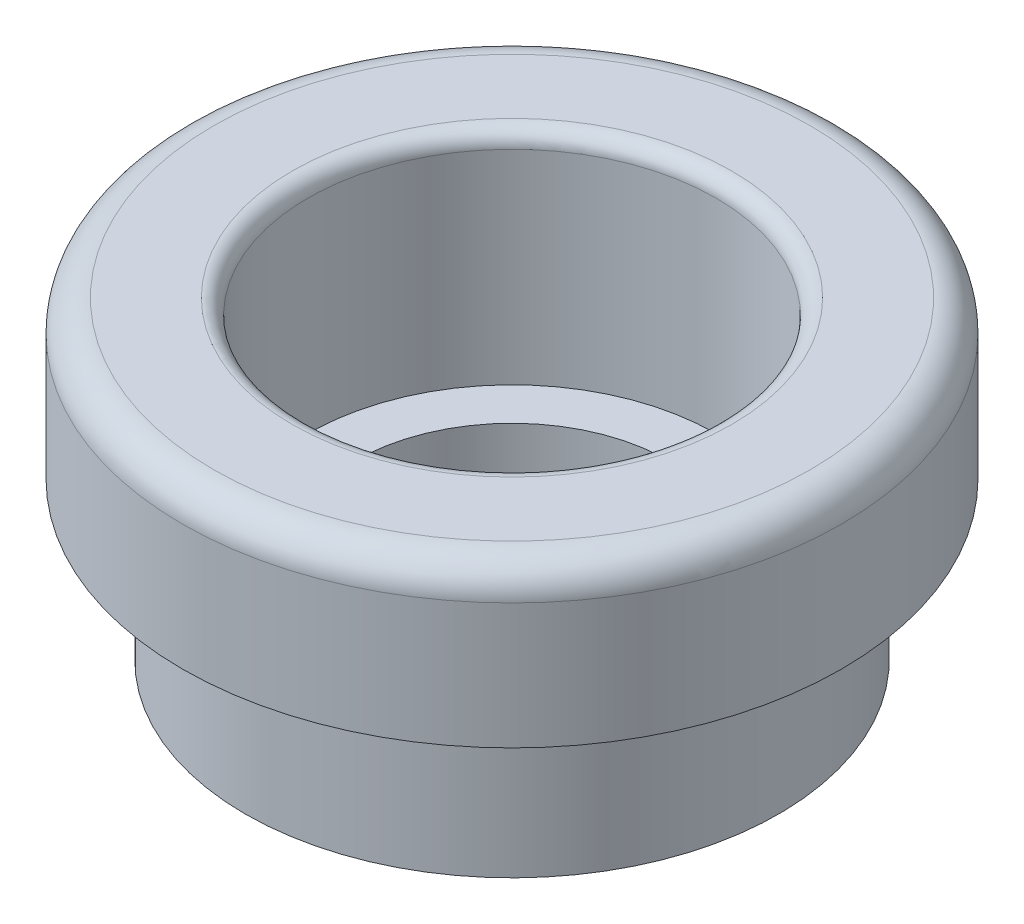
ISO-10303-21;
HEADER;
FILE_DESCRIPTION(('STEP AP214'),'2;1');
FILE_NAME('part.step','',(''),(''),'','','');
FILE_SCHEMA(('AUTOMOTIVE_DESIGN { 1 0 10303 214 1 1 1 1 }'));
ENDSEC;
DATA;
#1=APPLICATION_CONTEXT('core data for automotive mechanical design processes');
#2=APPLICATION_PROTOCOL_DEFINITION('international standard','automotive_design',2000,#1);
#3=PRODUCT_CONTEXT('',#1,'mechanical');
#4=PRODUCT('Part','Part','',(#3));
#5=PRODUCT_RELATED_PRODUCT_CATEGORY('part','',(#4));
#6=PRODUCT_DEFINITION_FORMATION('','',#4);
#7=PRODUCT_DEFINITION_CONTEXT('part definition',#1,'design');
#8=PRODUCT_DEFINITION('design','',#6,#7);
#9=PRODUCT_DEFINITION_SHAPE('','',#8);
#10=(LENGTH_UNIT() NAMED_UNIT(*) SI_UNIT(.MILLI.,.METRE.));
#11=(NAMED_UNIT(*) PLANE_ANGLE_UNIT() SI_UNIT($,.RADIAN.));
#12=(NAMED_UNIT(*) SI_UNIT($,.STERADIAN.) SOLID_ANGLE_UNIT());
#13=UNCERTAINTY_MEASURE_WITH_UNIT(LENGTH_MEASURE(1.E-05),#10,'distance_accuracy_value','');
#14=(GEOMETRIC_REPRESENTATION_CONTEXT(3) GLOBAL_UNCERTAINTY_ASSIGNED_CONTEXT((#13)) GLOBAL_UNIT_ASSIGNED_CONTEXT((#10,
#11,#12)) REPRESENTATION_CONTEXT('',''));
#15=CARTESIAN_POINT('',(0.,0.,0.));
#16=DIRECTION('',(0.,0.,1.));
#17=DIRECTION('',(1.,0.,0.));
#18=AXIS2_PLACEMENT_3D('',#15,#16,#17);
#19=CARTESIAN_POINT('',(0.,0.,0.));
#20=DIRECTION('',(0.,1.,0.));
#21=DIRECTION('',(0.,0.,1.));
#22=AXIS2_PLACEMENT_3D('',#19,#20,#21);
#23=CYLINDRICAL_SURFACE('',#22,5.);
#24=CARTESIAN_POINT('',(0.,0.,0.));
#25=DIRECTION('',(0.,1.,0.));
#26=DIRECTION('',(0.,0.,1.));
#27=AXIS2_PLACEMENT_3D('',#24,#25,#26);
#28=CIRCLE('',#27,5.);
#29=CARTESIAN_POINT('',(0.,0.,5.));
#30=VERTEX_POINT('',#29);
#31=EDGE_CURVE('E59',#30,#30,#28,.T.);
#32=ORIENTED_EDGE('',*,*,#31,.F.);
#33=EDGE_LOOP('',(#32));
#34=FACE_BOUND('',#33,.T.);
#35=CARTESIAN_POINT('',(0.,3.,0.));
#36=DIRECTION('',(0.,1.,0.));
#37=DIRECTION('',(0.,0.,1.));
#38=AXIS2_PLACEMENT_3D('',#35,#36,#37);
#39=CIRCLE('',#38,5.);
#40=CARTESIAN_POINT('',(0.,3.,5.));
#41=VERTEX_POINT('',#40);
#42=EDGE_CURVE('E56',#41,#41,#39,.F.);
#43=ORIENTED_EDGE('',*,*,#42,.F.);
#44=EDGE_LOOP('',(#43));
#45=FACE_BOUND('',#44,.T.);
#46=ADVANCED_FACE('F35',(#34,#45),#23,.F.);
#47=CARTESIAN_POINT('',(0.,5.,0.));
#48=DIRECTION('',(0.,-1.,0.));
#49=DIRECTION('',(0.,0.,-1.));
#50=AXIS2_PLACEMENT_3D('',#47,#48,#49);
#51=CYLINDRICAL_SURFACE('',#50,8.5);
#52=CARTESIAN_POINT('',(0.,5.,0.));
#53=DIRECTION('',(0.,1.,0.));
#54=DIRECTION('',(0.,0.,1.));
#55=AXIS2_PLACEMENT_3D('',#52,#53,#54);
#56=CIRCLE('',#55,8.5);
#57=CARTESIAN_POINT('',(0.,5.,8.5));
#58=VERTEX_POINT('',#57);
#59=EDGE_CURVE('E55',#58,#58,#56,.T.);
#60=ORIENTED_EDGE('',*,*,#59,.F.);
#61=EDGE_LOOP('',(#60));
#62=FACE_BOUND('',#61,.T.);
#63=CARTESIAN_POINT('',(0.,0.,0.));
#64=DIRECTION('',(0.,1.,0.));
#65=DIRECTION('',(0.,0.,1.));
#66=AXIS2_PLACEMENT_3D('',#63,#64,#65);
#67=CIRCLE('',#66,8.5);
#68=CARTESIAN_POINT('',(0.,0.,8.5));
#69=VERTEX_POINT('',#68);
#70=EDGE_CURVE('E61',#69,#69,#67,.T.);
#71=ORIENTED_EDGE('',*,*,#70,.T.);
#72=EDGE_LOOP('',(#71));
#73=FACE_BOUND('',#72,.T.);
#74=ADVANCED_FACE('F90',(#62,#73),#51,.T.);
#75=CARTESIAN_POINT('',(0.,0.,0.));
#76=DIRECTION('',(0.,1.,0.));
#77=DIRECTION('',(0.,0.,1.));
#78=AXIS2_PLACEMENT_3D('',#75,#76,#77);
#79=PLANE('',#78);
#80=ORIENTED_EDGE('',*,*,#31,.T.);
#81=EDGE_LOOP('',(#80));
#82=FACE_BOUND('',#81,.T.);
#83=ORIENTED_EDGE('',*,*,#70,.F.);
#84=EDGE_LOOP('',(#83));
#85=FACE_BOUND('',#84,.T.);
#86=ADVANCED_FACE('F95',(#82,#85),#79,.F.);
#87=CARTESIAN_POINT('',(0.,10.,0.));
#88=DIRECTION('',(0.,-1.,0.));
#89=DIRECTION('',(0.,0.,-1.));
#90=AXIS2_PLACEMENT_3D('',#87,#88,#89);
#91=CYLINDRICAL_SURFACE('',#90,10.5);
#92=CARTESIAN_POINT('',(0.,9.,0.));
#93=DIRECTION('',(0.,1.,0.));
#94=DIRECTION('',(0.,0.,1.));
#95=AXIS2_PLACEMENT_3D('',#92,#93,#94);
#96=CIRCLE('',#95,10.5);
#97=CARTESIAN_POINT('',(0.,9.,10.5));
#98=VERTEX_POINT('',#97);
#99=EDGE_CURVE('E46',#98,#98,#96,.F.);
#100=ORIENTED_EDGE('',*,*,#99,.T.);
#101=EDGE_LOOP('',(#100));
#102=FACE_BOUND('',#101,.T.);
#103=CARTESIAN_POINT('',(0.,5.,0.));
#104=DIRECTION('',(0.,1.,0.));
#105=DIRECTION('',(0.,0.,1.));
#106=AXIS2_PLACEMENT_3D('',#103,#104,#105);
#107=CIRCLE('',#106,10.5);
#108=CARTESIAN_POINT('',(0.,5.,10.5));
#109=VERTEX_POINT('',#108);
#110=EDGE_CURVE('E64',#109,#109,#107,.T.);
#111=ORIENTED_EDGE('',*,*,#110,.T.);
#112=EDGE_LOOP('',(#111));
#113=FACE_BOUND('',#112,.T.);
#114=ADVANCED_FACE('F104',(#102,#113),#91,.T.);
#115=CARTESIAN_POINT('',(0.,10.,0.));
#116=DIRECTION('',(0.,1.,0.));
#117=DIRECTION('',(0.,0.,1.));
#118=AXIS2_PLACEMENT_3D('',#115,#116,#117);
#119=PLANE('',#118);
#120=CARTESIAN_POINT('',(0.,10.,0.));
#121=DIRECTION('',(0.,1.,0.));
#122=DIRECTION('',(0.,0.,1.));
#123=AXIS2_PLACEMENT_3D('',#120,#121,#122);
#124=CIRCLE('',#123,7.);
#125=CARTESIAN_POINT('',(0.,10.,7.));
#126=VERTEX_POINT('',#125);
#127=EDGE_CURVE('E10',#126,#126,#124,.F.);
#128=ORIENTED_EDGE('',*,*,#127,.T.);
#129=EDGE_LOOP('',(#128));
#130=FACE_BOUND('',#129,.T.);
#131=CARTESIAN_POINT('',(0.,10.,0.));
#132=DIRECTION('',(0.,1.,0.));
#133=DIRECTION('',(0.,0.,1.));
#134=AXIS2_PLACEMENT_3D('',#131,#132,#133);
#135=CIRCLE('',#134,9.5);
#136=CARTESIAN_POINT('',(0.,10.,9.5));
#137=VERTEX_POINT('',#136);
#138=EDGE_CURVE('E50',#137,#137,#135,.T.);
#139=ORIENTED_EDGE('',*,*,#138,.T.);
#140=EDGE_LOOP('',(#139));
#141=FACE_BOUND('',#140,.T.);
#142=ADVANCED_FACE('F101',(#130,#141),#119,.T.);
#143=CARTESIAN_POINT('',(0.,5.,0.));
#144=DIRECTION('',(0.,1.,0.));
#145=DIRECTION('',(0.,0.,1.));
#146=AXIS2_PLACEMENT_3D('',#143,#144,#145);
#147=PLANE('',#146);
#148=ORIENTED_EDGE('',*,*,#59,.T.);
#149=EDGE_LOOP('',(#148));
#150=FACE_BOUND('',#149,.T.);
#151=ORIENTED_EDGE('',*,*,#110,.F.);
#152=EDGE_LOOP('',(#151));
#153=FACE_BOUND('',#152,.T.);
#154=ADVANCED_FACE('F86',(#150,#153),#147,.F.);
#155=CARTESIAN_POINT('',(0.,3.,0.));
#156=DIRECTION('',(0.,1.,0.));
#157=DIRECTION('',(0.,0.,1.));
#158=AXIS2_PLACEMENT_3D('',#155,#156,#157);
#159=PLANE('',#158);
#160=CARTESIAN_POINT('',(0.,3.,0.));
#161=DIRECTION('',(0.,1.,0.));
#162=DIRECTION('',(0.,0.,1.));
#163=AXIS2_PLACEMENT_3D('',#160,#161,#162);
#164=CIRCLE('',#163,6.5);
#165=CARTESIAN_POINT('',(0.,3.,6.5));
#166=VERTEX_POINT('',#165);
#167=EDGE_CURVE('E60',#166,#166,#164,.T.);
#168=ORIENTED_EDGE('',*,*,#167,.T.);
#169=EDGE_LOOP('',(#168));
#170=FACE_BOUND('',#169,.T.);
#171=ORIENTED_EDGE('',*,*,#42,.T.);
#172=EDGE_LOOP('',(#171));
#173=FACE_BOUND('',#172,.T.);
#174=ADVANCED_FACE('F74',(#170,#173),#159,.T.);
#175=CARTESIAN_POINT('',(0.,3.,0.));
#176=DIRECTION('',(0.,1.,0.));
#177=DIRECTION('',(0.,0.,1.));
#178=AXIS2_PLACEMENT_3D('',#175,#176,#177);
#179=CYLINDRICAL_SURFACE('',#178,6.5);
#180=CARTESIAN_POINT('',(0.,9.5,0.));
#181=DIRECTION('',(0.,1.,0.));
#182=DIRECTION('',(0.,0.,1.));
#183=AXIS2_PLACEMENT_3D('',#180,#181,#182);
#184=CIRCLE('',#183,6.5);
#185=CARTESIAN_POINT('',(0.,9.5,6.5));
#186=VERTEX_POINT('',#185);
#187=EDGE_CURVE('E42',#186,#186,#184,.T.);
#188=ORIENTED_EDGE('',*,*,#187,.T.);
#189=EDGE_LOOP('',(#188));
#190=FACE_BOUND('',#189,.T.);
#191=ORIENTED_EDGE('',*,*,#167,.F.);
#192=EDGE_LOOP('',(#191));
#193=FACE_BOUND('',#192,.T.);
#194=ADVANCED_FACE('F77',(#190,#193),#179,.F.);
#195=CARTESIAN_POINT('',(0.,9.,0.));
#196=DIRECTION('',(0.,1.,0.));
#197=DIRECTION('',(0.,0.,1.));
#198=AXIS2_PLACEMENT_3D('',#195,#196,#197);
#199=TOROIDAL_SURFACE('',#198,9.5,1.);
#200=ORIENTED_EDGE('',*,*,#99,.F.);
#201=EDGE_LOOP('',(#200));
#202=FACE_BOUND('',#201,.T.);
#203=ORIENTED_EDGE('',*,*,#138,.F.);
#204=EDGE_LOOP('',(#203));
#205=FACE_BOUND('',#204,.T.);
#206=ADVANCED_FACE('F79',(#202,#205),#199,.T.);
#207=CARTESIAN_POINT('',(0.,9.5,0.));
#208=DIRECTION('',(0.,1.,0.));
#209=DIRECTION('',(0.,0.,1.));
#210=AXIS2_PLACEMENT_3D('',#207,#208,#209);
#211=TOROIDAL_SURFACE('',#210,7.,0.5);
#212=ORIENTED_EDGE('',*,*,#127,.F.);
#213=EDGE_LOOP('',(#212));
#214=FACE_BOUND('',#213,.T.);
#215=ORIENTED_EDGE('',*,*,#187,.F.);
#216=EDGE_LOOP('',(#215));
#217=FACE_BOUND('',#216,.T.);
#218=ADVANCED_FACE('F37',(#214,#217),#211,.T.);
#219=CLOSED_SHELL('',(#46,#74,#86,#114,#142,#154,#174,#194,#206,#218));
#220=MANIFOLD_SOLID_BREP('B2',#219);
#221=ADVANCED_BREP_SHAPE_REPRESENTATION('',(#18,#220),#14);
#222=SHAPE_DEFINITION_REPRESENTATION(#9,#221);
ENDSEC;
END-ISO-10303-21;
